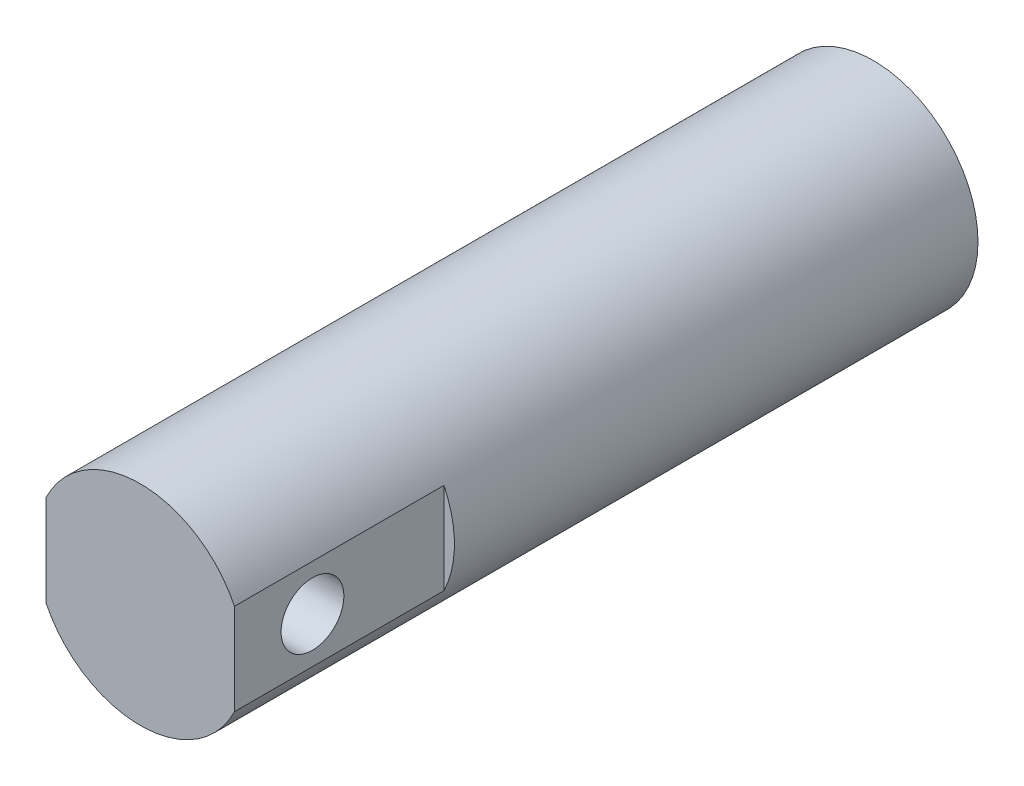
from build123d import *

# Parameters (mm, degrees)
CROQUIS1_R                 = 5
SALIENTE_EXTRUIR1_DEPTH    = 35
CORTAR_EXTRUIR1_DEPTH      = 36.707142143
CORTAR_EXTRUIR1_DEPTH_BACK = 36.707142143
CROQUIS2_R                 = 1.5
CROQUIS3_OUTSIDE_W         = 19.55
CROQUIS3_OUTSIDE_H         = 19.55
CROQUIS3_OUTSIDE_W_2       = 9
CROQUIS3_OUTSIDE_H_2       = 10.339788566
CORTAR_EXTRUIR2_DEPTH      = 10


with BuildPart() as part:
    # Croquis1 → Saliente-Extruir1 (new body)
    with BuildSketch(Plane.XY):
        Circle(CROQUIS1_R)
    extrude(amount=SALIENTE_EXTRUIR1_DEPTH)

    # Croquis2 → Cortar-Extruir1 (cut, two sides: drawn at the far end of the back side and taken through both)
    with BuildSketch(Plane(origin=(0, 0, 0), x_dir=(0, 0, -1), z_dir=(1, 0, 0)).offset(-CORTAR_EXTRUIR1_DEPTH_BACK)):
        with Locations((-31.277024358, 0)):
            Circle(CROQUIS2_R)
    extrude(amount=CORTAR_EXTRUIR1_DEPTH + CORTAR_EXTRUIR1_DEPTH_BACK, mode=Mode.SUBTRACT)

    # Croquis3 outside → Cortar-Extruir2 (cut)
    with BuildSketch(Plane.XY.offset(35)):
        Rectangle(CROQUIS3_OUTSIDE_W, CROQUIS3_OUTSIDE_H)
        Rectangle(CROQUIS3_OUTSIDE_W_2, CROQUIS3_OUTSIDE_H_2, mode=Mode.SUBTRACT)
    extrude(amount=-CORTAR_EXTRUIR2_DEPTH, mode=Mode.SUBTRACT)


solid = part.part
